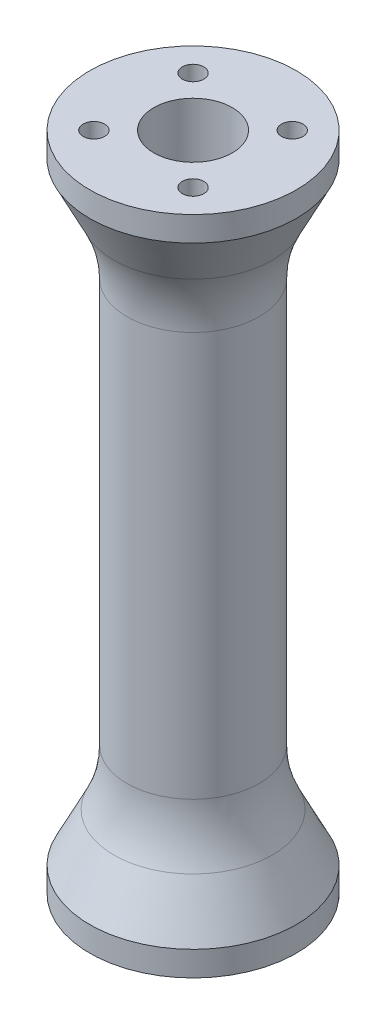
ISO-10303-21;
HEADER;
FILE_DESCRIPTION(('STEP AP214'),'2;1');
FILE_NAME('part.step','',(''),(''),'','','');
FILE_SCHEMA(('AUTOMOTIVE_DESIGN { 1 0 10303 214 1 1 1 1 }'));
ENDSEC;
DATA;
#1=APPLICATION_CONTEXT('core data for automotive mechanical design processes');
#2=APPLICATION_PROTOCOL_DEFINITION('international standard','automotive_design',2000,#1);
#3=PRODUCT_CONTEXT('',#1,'mechanical');
#4=PRODUCT('Part','Part','',(#3));
#5=PRODUCT_RELATED_PRODUCT_CATEGORY('part','',(#4));
#6=PRODUCT_DEFINITION_FORMATION('','',#4);
#7=PRODUCT_DEFINITION_CONTEXT('part definition',#1,'design');
#8=PRODUCT_DEFINITION('design','',#6,#7);
#9=PRODUCT_DEFINITION_SHAPE('','',#8);
#10=(LENGTH_UNIT() NAMED_UNIT(*) SI_UNIT(.MILLI.,.METRE.));
#11=(NAMED_UNIT(*) PLANE_ANGLE_UNIT() SI_UNIT($,.RADIAN.));
#12=(NAMED_UNIT(*) SI_UNIT($,.STERADIAN.) SOLID_ANGLE_UNIT());
#13=UNCERTAINTY_MEASURE_WITH_UNIT(LENGTH_MEASURE(1.E-05),#10,'distance_accuracy_value','');
#14=(GEOMETRIC_REPRESENTATION_CONTEXT(3) GLOBAL_UNCERTAINTY_ASSIGNED_CONTEXT((#13)) GLOBAL_UNIT_ASSIGNED_CONTEXT((#10,
#11,#12)) REPRESENTATION_CONTEXT('',''));
#15=CARTESIAN_POINT('',(0.,0.,0.));
#16=DIRECTION('',(0.,0.,1.));
#17=DIRECTION('',(1.,0.,0.));
#18=AXIS2_PLACEMENT_3D('',#15,#16,#17);
#19=CARTESIAN_POINT('',(0.,40.,0.));
#20=DIRECTION('',(0.,-1.,0.));
#21=DIRECTION('',(0.,0.,-1.));
#22=AXIS2_PLACEMENT_3D('',#19,#20,#21);
#23=PLANE('',#22);
#24=CARTESIAN_POINT('',(0.,40.,0.));
#25=DIRECTION('',(0.,1.,0.));
#26=DIRECTION('',(0.,0.,1.));
#27=AXIS2_PLACEMENT_3D('',#24,#25,#26);
#28=CIRCLE('',#27,4.75);
#29=CARTESIAN_POINT('',(0.,40.,4.75));
#30=VERTEX_POINT('',#29);
#31=EDGE_CURVE('E170',#30,#30,#28,.T.);
#32=ORIENTED_EDGE('',*,*,#31,.F.);
#33=EDGE_LOOP('',(#32));
#34=FACE_BOUND('',#33,.T.);
#35=CARTESIAN_POINT('',(6.,40.,-6.));
#36=DIRECTION('',(0.,1.,0.));
#37=DIRECTION('',(0.,0.,1.));
#38=AXIS2_PLACEMENT_3D('',#35,#36,#37);
#39=CIRCLE('',#38,1.3);
#40=CARTESIAN_POINT('',(6.,40.,-4.7));
#41=VERTEX_POINT('',#40);
#42=EDGE_CURVE('E108',#41,#41,#39,.T.);
#43=ORIENTED_EDGE('',*,*,#42,.F.);
#44=EDGE_LOOP('',(#43));
#45=FACE_BOUND('',#44,.T.);
#46=CARTESIAN_POINT('',(-6.,40.,6.));
#47=DIRECTION('',(0.,1.,0.));
#48=DIRECTION('',(0.,0.,1.));
#49=AXIS2_PLACEMENT_3D('',#46,#47,#48);
#50=CIRCLE('',#49,1.3);
#51=CARTESIAN_POINT('',(-6.,40.,7.3));
#52=VERTEX_POINT('',#51);
#53=EDGE_CURVE('E116',#52,#52,#50,.T.);
#54=ORIENTED_EDGE('',*,*,#53,.F.);
#55=EDGE_LOOP('',(#54));
#56=FACE_BOUND('',#55,.T.);
#57=CARTESIAN_POINT('',(6.,40.,6.));
#58=DIRECTION('',(0.,1.,0.));
#59=DIRECTION('',(0.,0.,1.));
#60=AXIS2_PLACEMENT_3D('',#57,#58,#59);
#61=CIRCLE('',#60,1.3);
#62=CARTESIAN_POINT('',(6.,40.,7.3));
#63=VERTEX_POINT('',#62);
#64=EDGE_CURVE('E117',#63,#63,#61,.T.);
#65=ORIENTED_EDGE('',*,*,#64,.F.);
#66=EDGE_LOOP('',(#65));
#67=FACE_BOUND('',#66,.T.);
#68=CARTESIAN_POINT('',(-6.,40.,-6.));
#69=DIRECTION('',(0.,1.,0.));
#70=DIRECTION('',(0.,0.,1.));
#71=AXIS2_PLACEMENT_3D('',#68,#69,#70);
#72=CIRCLE('',#71,1.3);
#73=CARTESIAN_POINT('',(-6.,40.,-4.7));
#74=VERTEX_POINT('',#73);
#75=EDGE_CURVE('E104',#74,#74,#72,.T.);
#76=ORIENTED_EDGE('',*,*,#75,.F.);
#77=EDGE_LOOP('',(#76));
#78=FACE_BOUND('',#77,.T.);
#79=CARTESIAN_POINT('',(0.,40.,0.));
#80=DIRECTION('',(0.,-1.,0.));
#81=DIRECTION('',(0.,0.,-1.));
#82=AXIS2_PLACEMENT_3D('',#79,#80,#81);
#83=CIRCLE('',#82,12.5);
#84=CARTESIAN_POINT('',(0.,40.,-12.5));
#85=VERTEX_POINT('',#84);
#86=EDGE_CURVE('E81',#85,#85,#83,.T.);
#87=ORIENTED_EDGE('',*,*,#86,.F.);
#88=EDGE_LOOP('',(#87));
#89=FACE_BOUND('',#88,.T.);
#90=ADVANCED_FACE('F41',(#34,#45,#56,#67,#78,#89),#23,.F.);
#91=CARTESIAN_POINT('',(0.,-40.,0.));
#92=DIRECTION('',(0.,-1.,0.));
#93=DIRECTION('',(0.,0.,-1.));
#94=AXIS2_PLACEMENT_3D('',#91,#92,#93);
#95=CYLINDRICAL_SURFACE('',#94,12.5);
#96=CARTESIAN_POINT('',(0.,37.,0.));
#97=DIRECTION('',(0.,-1.,0.));
#98=DIRECTION('',(0.,0.,-1.));
#99=AXIS2_PLACEMENT_3D('',#96,#97,#98);
#100=CIRCLE('',#99,12.5);
#101=CARTESIAN_POINT('',(0.,37.,-12.5));
#102=VERTEX_POINT('',#101);
#103=EDGE_CURVE('E91',#102,#102,#100,.T.);
#104=ORIENTED_EDGE('',*,*,#103,.F.);
#105=EDGE_LOOP('',(#104));
#106=FACE_BOUND('',#105,.T.);
#107=ORIENTED_EDGE('',*,*,#86,.T.);
#108=EDGE_LOOP('',(#107));
#109=FACE_BOUND('',#108,.T.);
#110=ADVANCED_FACE('F205',(#106,#109),#95,.T.);
#111=CARTESIAN_POINT('',(0.,37.,0.));
#112=DIRECTION('',(0.,1.,0.));
#113=DIRECTION('',(0.,0.,1.));
#114=AXIS2_PLACEMENT_3D('',#111,#112,#113);
#115=CONICAL_SURFACE('',#114,12.5,0.463647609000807);
#116=CARTESIAN_POINT('',(0.,31.1671842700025,0.));
#117=DIRECTION('',(0.,1.,0.));
#118=DIRECTION('',(0.,0.,1.));
#119=AXIS2_PLACEMENT_3D('',#116,#117,#118);
#120=CIRCLE('',#119,9.58359213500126);
#121=CARTESIAN_POINT('',(0.,31.1671842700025,9.58359213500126));
#122=VERTEX_POINT('',#121);
#123=EDGE_CURVE('E65',#122,#122,#120,.T.);
#124=ORIENTED_EDGE('',*,*,#123,.T.);
#125=EDGE_LOOP('',(#124));
#126=FACE_BOUND('',#125,.T.);
#127=ORIENTED_EDGE('',*,*,#103,.T.);
#128=EDGE_LOOP('',(#127));
#129=FACE_BOUND('',#128,.T.);
#130=ADVANCED_FACE('F211',(#126,#129),#115,.T.);
#131=CARTESIAN_POINT('',(0.,-40.,0.));
#132=DIRECTION('',(0.,-1.,0.));
#133=DIRECTION('',(0.,0.,-1.));
#134=AXIS2_PLACEMENT_3D('',#131,#132,#133);
#135=CYLINDRICAL_SURFACE('',#134,7.99999999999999);
#136=CARTESIAN_POINT('',(0.,-24.4589803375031,0.));
#137=DIRECTION('',(0.,-1.,0.));
#138=DIRECTION('',(0.,0.,-1.));
#139=AXIS2_PLACEMENT_3D('',#136,#137,#138);
#140=CIRCLE('',#139,7.99999999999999);
#141=CARTESIAN_POINT('',(0.,-24.4589803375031,-7.99999999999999));
#142=VERTEX_POINT('',#141);
#143=EDGE_CURVE('E69',#142,#142,#140,.F.);
#144=ORIENTED_EDGE('',*,*,#143,.T.);
#145=EDGE_LOOP('',(#144));
#146=FACE_BOUND('',#145,.T.);
#147=CARTESIAN_POINT('',(0.,24.4589803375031,0.));
#148=DIRECTION('',(0.,-1.,0.));
#149=DIRECTION('',(0.,0.,-1.));
#150=AXIS2_PLACEMENT_3D('',#147,#148,#149);
#151=CIRCLE('',#150,7.99999999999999);
#152=CARTESIAN_POINT('',(0.,24.4589803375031,-7.99999999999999));
#153=VERTEX_POINT('',#152);
#154=EDGE_CURVE('E73',#153,#153,#151,.T.);
#155=ORIENTED_EDGE('',*,*,#154,.T.);
#156=EDGE_LOOP('',(#155));
#157=FACE_BOUND('',#156,.T.);
#158=ADVANCED_FACE('F313',(#146,#157),#135,.T.);
#159=CARTESIAN_POINT('',(0.,-28.,0.));
#160=DIRECTION('',(0.,-1.,0.));
#161=DIRECTION('',(0.,0.,-1.));
#162=AXIS2_PLACEMENT_3D('',#159,#160,#161);
#163=CONICAL_SURFACE('',#162,7.99999999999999,0.463647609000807);
#164=CARTESIAN_POINT('',(0.,-31.1671842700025,0.));
#165=DIRECTION('',(0.,-1.,0.));
#166=DIRECTION('',(0.,0.,-1.));
#167=AXIS2_PLACEMENT_3D('',#164,#165,#166);
#168=CIRCLE('',#167,9.58359213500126);
#169=CARTESIAN_POINT('',(0.,-31.1671842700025,-9.58359213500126));
#170=VERTEX_POINT('',#169);
#171=EDGE_CURVE('E77',#170,#170,#168,.T.);
#172=ORIENTED_EDGE('',*,*,#171,.T.);
#173=EDGE_LOOP('',(#172));
#174=FACE_BOUND('',#173,.T.);
#175=CARTESIAN_POINT('',(0.,-37.,0.));
#176=DIRECTION('',(0.,-1.,0.));
#177=DIRECTION('',(0.,0.,-1.));
#178=AXIS2_PLACEMENT_3D('',#175,#176,#177);
#179=CIRCLE('',#178,12.5);
#180=CARTESIAN_POINT('',(0.,-37.,-12.5));
#181=VERTEX_POINT('',#180);
#182=EDGE_CURVE('E95',#181,#181,#179,.T.);
#183=ORIENTED_EDGE('',*,*,#182,.F.);
#184=EDGE_LOOP('',(#183));
#185=FACE_BOUND('',#184,.T.);
#186=ADVANCED_FACE('F309',(#174,#185),#163,.T.);
#187=CARTESIAN_POINT('',(0.,-40.,0.));
#188=DIRECTION('',(0.,-1.,0.));
#189=DIRECTION('',(0.,0.,-1.));
#190=AXIS2_PLACEMENT_3D('',#187,#188,#189);
#191=CYLINDRICAL_SURFACE('',#190,12.5);
#192=CARTESIAN_POINT('',(0.,-40.,0.));
#193=DIRECTION('',(0.,-1.,0.));
#194=DIRECTION('',(0.,0.,-1.));
#195=AXIS2_PLACEMENT_3D('',#192,#193,#194);
#196=CIRCLE('',#195,12.5);
#197=CARTESIAN_POINT('',(0.,-40.,-12.5));
#198=VERTEX_POINT('',#197);
#199=EDGE_CURVE('E99',#198,#198,#196,.T.);
#200=ORIENTED_EDGE('',*,*,#199,.F.);
#201=EDGE_LOOP('',(#200));
#202=FACE_BOUND('',#201,.T.);
#203=ORIENTED_EDGE('',*,*,#182,.T.);
#204=EDGE_LOOP('',(#203));
#205=FACE_BOUND('',#204,.T.);
#206=ADVANCED_FACE('F306',(#202,#205),#191,.T.);
#207=CARTESIAN_POINT('',(0.,-40.,0.));
#208=DIRECTION('',(0.,1.,0.));
#209=DIRECTION('',(0.,0.,1.));
#210=AXIS2_PLACEMENT_3D('',#207,#208,#209);
#211=PLANE('',#210);
#212=CARTESIAN_POINT('',(0.,-40.,0.));
#213=DIRECTION('',(0.,1.,0.));
#214=DIRECTION('',(0.,0.,1.));
#215=AXIS2_PLACEMENT_3D('',#212,#213,#214);
#216=CIRCLE('',#215,4.75);
#217=CARTESIAN_POINT('',(0.,-40.,4.75));
#218=VERTEX_POINT('',#217);
#219=EDGE_CURVE('E87',#218,#218,#216,.T.);
#220=ORIENTED_EDGE('',*,*,#219,.T.);
#221=EDGE_LOOP('',(#220));
#222=FACE_BOUND('',#221,.T.);
#223=CARTESIAN_POINT('',(6.,-40.,-6.));
#224=DIRECTION('',(0.,1.,0.));
#225=DIRECTION('',(0.,0.,1.));
#226=AXIS2_PLACEMENT_3D('',#223,#224,#225);
#227=CIRCLE('',#226,1.3);
#228=CARTESIAN_POINT('',(6.,-40.,-4.7));
#229=VERTEX_POINT('',#228);
#230=EDGE_CURVE('E153',#229,#229,#227,.T.);
#231=ORIENTED_EDGE('',*,*,#230,.T.);
#232=EDGE_LOOP('',(#231));
#233=FACE_BOUND('',#232,.T.);
#234=CARTESIAN_POINT('',(-6.,-40.,6.));
#235=DIRECTION('',(0.,1.,0.));
#236=DIRECTION('',(0.,0.,1.));
#237=AXIS2_PLACEMENT_3D('',#234,#235,#236);
#238=CIRCLE('',#237,1.3);
#239=CARTESIAN_POINT('',(-6.,-40.,7.3));
#240=VERTEX_POINT('',#239);
#241=EDGE_CURVE('E144',#240,#240,#238,.T.);
#242=ORIENTED_EDGE('',*,*,#241,.T.);
#243=EDGE_LOOP('',(#242));
#244=FACE_BOUND('',#243,.T.);
#245=CARTESIAN_POINT('',(6.,-40.,6.));
#246=DIRECTION('',(0.,1.,0.));
#247=DIRECTION('',(0.,0.,1.));
#248=AXIS2_PLACEMENT_3D('',#245,#246,#247);
#249=CIRCLE('',#248,1.3);
#250=CARTESIAN_POINT('',(6.,-40.,7.3));
#251=VERTEX_POINT('',#250);
#252=EDGE_CURVE('E160',#251,#251,#249,.T.);
#253=ORIENTED_EDGE('',*,*,#252,.T.);
#254=EDGE_LOOP('',(#253));
#255=FACE_BOUND('',#254,.T.);
#256=CARTESIAN_POINT('',(-6.,-40.,-6.));
#257=DIRECTION('',(0.,1.,0.));
#258=DIRECTION('',(0.,0.,1.));
#259=AXIS2_PLACEMENT_3D('',#256,#257,#258);
#260=CIRCLE('',#259,1.3);
#261=CARTESIAN_POINT('',(-6.,-40.,-4.7));
#262=VERTEX_POINT('',#261);
#263=EDGE_CURVE('E136',#262,#262,#260,.T.);
#264=ORIENTED_EDGE('',*,*,#263,.T.);
#265=EDGE_LOOP('',(#264));
#266=FACE_BOUND('',#265,.T.);
#267=ORIENTED_EDGE('',*,*,#199,.T.);
#268=EDGE_LOOP('',(#267));
#269=FACE_BOUND('',#268,.T.);
#270=ADVANCED_FACE('F178',(#222,#233,#244,#255,#266,#269),#211,.F.);
#271=CARTESIAN_POINT('',(-6.,33.,-6.));
#272=DIRECTION('',(0.,1.,0.));
#273=DIRECTION('',(0.,0.,1.));
#274=AXIS2_PLACEMENT_3D('',#271,#272,#273);
#275=CYLINDRICAL_SURFACE('',#274,1.3);
#276=CARTESIAN_POINT('',(-6.,33.,-6.));
#277=DIRECTION('',(0.,1.,0.));
#278=DIRECTION('',(0.,0.,1.));
#279=AXIS2_PLACEMENT_3D('',#276,#277,#278);
#280=CIRCLE('',#279,1.3);
#281=CARTESIAN_POINT('',(-6.,33.,-4.7));
#282=VERTEX_POINT('',#281);
#283=EDGE_CURVE('E103',#282,#282,#280,.T.);
#284=ORIENTED_EDGE('',*,*,#283,.F.);
#285=EDGE_LOOP('',(#284));
#286=FACE_BOUND('',#285,.T.);
#287=ORIENTED_EDGE('',*,*,#75,.T.);
#288=EDGE_LOOP('',(#287));
#289=FACE_BOUND('',#288,.T.);
#290=ADVANCED_FACE('F299',(#286,#289),#275,.F.);
#291=CARTESIAN_POINT('',(-6.,33.,-6.));
#292=DIRECTION('',(0.,1.,0.));
#293=DIRECTION('',(0.,0.,1.));
#294=AXIS2_PLACEMENT_3D('',#291,#292,#293);
#295=PLANE('',#294);
#296=ORIENTED_EDGE('',*,*,#283,.T.);
#297=EDGE_LOOP('',(#296));
#298=FACE_BOUND('',#297,.T.);
#299=ADVANCED_FACE('F277',(#298),#295,.T.);
#300=CARTESIAN_POINT('',(6.,33.,6.));
#301=DIRECTION('',(0.,1.,0.));
#302=DIRECTION('',(0.,0.,1.));
#303=AXIS2_PLACEMENT_3D('',#300,#301,#302);
#304=CYLINDRICAL_SURFACE('',#303,1.3);
#305=CARTESIAN_POINT('',(6.,33.,6.));
#306=DIRECTION('',(0.,1.,0.));
#307=DIRECTION('',(0.,0.,1.));
#308=AXIS2_PLACEMENT_3D('',#305,#306,#307);
#309=CIRCLE('',#308,1.3);
#310=CARTESIAN_POINT('',(6.,33.,7.3));
#311=VERTEX_POINT('',#310);
#312=EDGE_CURVE('E128',#311,#311,#309,.T.);
#313=ORIENTED_EDGE('',*,*,#312,.F.);
#314=EDGE_LOOP('',(#313));
#315=FACE_BOUND('',#314,.T.);
#316=ORIENTED_EDGE('',*,*,#64,.T.);
#317=EDGE_LOOP('',(#316));
#318=FACE_BOUND('',#317,.T.);
#319=ADVANCED_FACE('F273',(#315,#318),#304,.F.);
#320=CARTESIAN_POINT('',(6.,33.,6.));
#321=DIRECTION('',(0.,1.,0.));
#322=DIRECTION('',(0.,0.,1.));
#323=AXIS2_PLACEMENT_3D('',#320,#321,#322);
#324=PLANE('',#323);
#325=ORIENTED_EDGE('',*,*,#312,.T.);
#326=EDGE_LOOP('',(#325));
#327=FACE_BOUND('',#326,.T.);
#328=ADVANCED_FACE('F276',(#327),#324,.T.);
#329=CARTESIAN_POINT('',(-6.,33.,6.));
#330=DIRECTION('',(0.,1.,0.));
#331=DIRECTION('',(0.,0.,1.));
#332=AXIS2_PLACEMENT_3D('',#329,#330,#331);
#333=CYLINDRICAL_SURFACE('',#332,1.3);
#334=CARTESIAN_POINT('',(-6.,33.,6.));
#335=DIRECTION('',(0.,1.,0.));
#336=DIRECTION('',(0.,0.,1.));
#337=AXIS2_PLACEMENT_3D('',#334,#335,#336);
#338=CIRCLE('',#337,1.3);
#339=CARTESIAN_POINT('',(-6.,33.,7.3));
#340=VERTEX_POINT('',#339);
#341=EDGE_CURVE('E112',#340,#340,#338,.T.);
#342=ORIENTED_EDGE('',*,*,#341,.F.);
#343=EDGE_LOOP('',(#342));
#344=FACE_BOUND('',#343,.T.);
#345=ORIENTED_EDGE('',*,*,#53,.T.);
#346=EDGE_LOOP('',(#345));
#347=FACE_BOUND('',#346,.T.);
#348=ADVANCED_FACE('F281',(#344,#347),#333,.F.);
#349=CARTESIAN_POINT('',(-6.,33.,6.));
#350=DIRECTION('',(0.,1.,0.));
#351=DIRECTION('',(0.,0.,1.));
#352=AXIS2_PLACEMENT_3D('',#349,#350,#351);
#353=PLANE('',#352);
#354=ORIENTED_EDGE('',*,*,#341,.T.);
#355=EDGE_LOOP('',(#354));
#356=FACE_BOUND('',#355,.T.);
#357=ADVANCED_FACE('F286',(#356),#353,.T.);
#358=CARTESIAN_POINT('',(6.,33.,-6.));
#359=DIRECTION('',(0.,1.,0.));
#360=DIRECTION('',(0.,0.,1.));
#361=AXIS2_PLACEMENT_3D('',#358,#359,#360);
#362=CYLINDRICAL_SURFACE('',#361,1.3);
#363=CARTESIAN_POINT('',(6.,33.,-6.));
#364=DIRECTION('',(0.,1.,0.));
#365=DIRECTION('',(0.,0.,1.));
#366=AXIS2_PLACEMENT_3D('',#363,#364,#365);
#367=CIRCLE('',#366,1.3);
#368=CARTESIAN_POINT('',(6.,33.,-4.7));
#369=VERTEX_POINT('',#368);
#370=EDGE_CURVE('E121',#369,#369,#367,.T.);
#371=ORIENTED_EDGE('',*,*,#370,.F.);
#372=EDGE_LOOP('',(#371));
#373=FACE_BOUND('',#372,.T.);
#374=ORIENTED_EDGE('',*,*,#42,.T.);
#375=EDGE_LOOP('',(#374));
#376=FACE_BOUND('',#375,.T.);
#377=ADVANCED_FACE('F283',(#373,#376),#362,.F.);
#378=CARTESIAN_POINT('',(6.,33.,-6.));
#379=DIRECTION('',(0.,1.,0.));
#380=DIRECTION('',(0.,0.,1.));
#381=AXIS2_PLACEMENT_3D('',#378,#379,#380);
#382=PLANE('',#381);
#383=ORIENTED_EDGE('',*,*,#370,.T.);
#384=EDGE_LOOP('',(#383));
#385=FACE_BOUND('',#384,.T.);
#386=ADVANCED_FACE('F271',(#385),#382,.T.);
#387=CARTESIAN_POINT('',(-6.,-33.,-6.));
#388=DIRECTION('',(0.,-1.,0.));
#389=DIRECTION('',(0.,0.,-1.));
#390=AXIS2_PLACEMENT_3D('',#387,#388,#389);
#391=CYLINDRICAL_SURFACE('',#390,1.3);
#392=CARTESIAN_POINT('',(-6.,-33.,-6.));
#393=DIRECTION('',(0.,1.,0.));
#394=DIRECTION('',(0.,0.,1.));
#395=AXIS2_PLACEMENT_3D('',#392,#393,#394);
#396=CIRCLE('',#395,1.3);
#397=CARTESIAN_POINT('',(-6.,-33.,-4.7));
#398=VERTEX_POINT('',#397);
#399=EDGE_CURVE('E132',#398,#398,#396,.T.);
#400=ORIENTED_EDGE('',*,*,#399,.T.);
#401=EDGE_LOOP('',(#400));
#402=FACE_BOUND('',#401,.T.);
#403=ORIENTED_EDGE('',*,*,#263,.F.);
#404=EDGE_LOOP('',(#403));
#405=FACE_BOUND('',#404,.T.);
#406=ADVANCED_FACE('F267',(#402,#405),#391,.F.);
#407=CARTESIAN_POINT('',(-6.,-33.,-6.));
#408=DIRECTION('',(0.,-1.,0.));
#409=DIRECTION('',(0.,0.,1.));
#410=AXIS2_PLACEMENT_3D('',#407,#408,#409);
#411=PLANE('',#410);
#412=ORIENTED_EDGE('',*,*,#399,.F.);
#413=EDGE_LOOP('',(#412));
#414=FACE_BOUND('',#413,.T.);
#415=ADVANCED_FACE('F249',(#414),#411,.T.);
#416=CARTESIAN_POINT('',(6.,-33.,6.));
#417=DIRECTION('',(0.,-1.,0.));
#418=DIRECTION('',(0.,0.,-1.));
#419=AXIS2_PLACEMENT_3D('',#416,#417,#418);
#420=CYLINDRICAL_SURFACE('',#419,1.3);
#421=CARTESIAN_POINT('',(6.,-33.,6.));
#422=DIRECTION('',(0.,1.,0.));
#423=DIRECTION('',(0.,0.,1.));
#424=AXIS2_PLACEMENT_3D('',#421,#422,#423);
#425=CIRCLE('',#424,1.3);
#426=CARTESIAN_POINT('',(6.,-33.,7.3));
#427=VERTEX_POINT('',#426);
#428=EDGE_CURVE('E149',#427,#427,#425,.T.);
#429=ORIENTED_EDGE('',*,*,#428,.T.);
#430=EDGE_LOOP('',(#429));
#431=FACE_BOUND('',#430,.T.);
#432=ORIENTED_EDGE('',*,*,#252,.F.);
#433=EDGE_LOOP('',(#432));
#434=FACE_BOUND('',#433,.T.);
#435=ADVANCED_FACE('F245',(#431,#434),#420,.F.);
#436=CARTESIAN_POINT('',(6.,-33.,6.));
#437=DIRECTION('',(0.,-1.,0.));
#438=DIRECTION('',(0.,0.,1.));
#439=AXIS2_PLACEMENT_3D('',#436,#437,#438);
#440=PLANE('',#439);
#441=ORIENTED_EDGE('',*,*,#428,.F.);
#442=EDGE_LOOP('',(#441));
#443=FACE_BOUND('',#442,.T.);
#444=ADVANCED_FACE('F241',(#443),#440,.T.);
#445=CARTESIAN_POINT('',(-6.,-33.,6.));
#446=DIRECTION('',(0.,-1.,0.));
#447=DIRECTION('',(0.,0.,-1.));
#448=AXIS2_PLACEMENT_3D('',#445,#446,#447);
#449=CYLINDRICAL_SURFACE('',#448,1.3);
#450=CARTESIAN_POINT('',(-6.,-33.,6.));
#451=DIRECTION('',(0.,1.,0.));
#452=DIRECTION('',(0.,0.,1.));
#453=AXIS2_PLACEMENT_3D('',#450,#451,#452);
#454=CIRCLE('',#453,1.3);
#455=CARTESIAN_POINT('',(-6.,-33.,7.3));
#456=VERTEX_POINT('',#455);
#457=EDGE_CURVE('E148',#456,#456,#454,.T.);
#458=ORIENTED_EDGE('',*,*,#457,.T.);
#459=EDGE_LOOP('',(#458));
#460=FACE_BOUND('',#459,.T.);
#461=ORIENTED_EDGE('',*,*,#241,.F.);
#462=EDGE_LOOP('',(#461));
#463=FACE_BOUND('',#462,.T.);
#464=ADVANCED_FACE('F244',(#460,#463),#449,.F.);
#465=CARTESIAN_POINT('',(-6.,-33.,6.));
#466=DIRECTION('',(0.,-1.,0.));
#467=DIRECTION('',(0.,0.,1.));
#468=AXIS2_PLACEMENT_3D('',#465,#466,#467);
#469=PLANE('',#468);
#470=ORIENTED_EDGE('',*,*,#457,.F.);
#471=EDGE_LOOP('',(#470));
#472=FACE_BOUND('',#471,.T.);
#473=ADVANCED_FACE('F257',(#472),#469,.T.);
#474=CARTESIAN_POINT('',(6.,-33.,-6.));
#475=DIRECTION('',(0.,-1.,0.));
#476=DIRECTION('',(0.,0.,-1.));
#477=AXIS2_PLACEMENT_3D('',#474,#475,#476);
#478=CYLINDRICAL_SURFACE('',#477,1.3);
#479=CARTESIAN_POINT('',(6.,-33.,-6.));
#480=DIRECTION('',(0.,1.,0.));
#481=DIRECTION('',(0.,0.,1.));
#482=AXIS2_PLACEMENT_3D('',#479,#480,#481);
#483=CIRCLE('',#482,1.3);
#484=CARTESIAN_POINT('',(6.,-33.,-4.7));
#485=VERTEX_POINT('',#484);
#486=EDGE_CURVE('E140',#485,#485,#483,.T.);
#487=ORIENTED_EDGE('',*,*,#486,.T.);
#488=EDGE_LOOP('',(#487));
#489=FACE_BOUND('',#488,.T.);
#490=ORIENTED_EDGE('',*,*,#230,.F.);
#491=EDGE_LOOP('',(#490));
#492=FACE_BOUND('',#491,.T.);
#493=ADVANCED_FACE('F253',(#489,#492),#478,.F.);
#494=CARTESIAN_POINT('',(6.,-33.,-6.));
#495=DIRECTION('',(0.,-1.,0.));
#496=DIRECTION('',(0.,0.,1.));
#497=AXIS2_PLACEMENT_3D('',#494,#495,#496);
#498=PLANE('',#497);
#499=ORIENTED_EDGE('',*,*,#486,.F.);
#500=EDGE_LOOP('',(#499));
#501=FACE_BOUND('',#500,.T.);
#502=ADVANCED_FACE('F185',(#501),#498,.T.);
#503=CARTESIAN_POINT('',(0.,-40.,0.));
#504=DIRECTION('',(0.,1.,0.));
#505=DIRECTION('',(0.,0.,1.));
#506=AXIS2_PLACEMENT_3D('',#503,#504,#505);
#507=CYLINDRICAL_SURFACE('',#506,4.75);
#508=ORIENTED_EDGE('',*,*,#219,.F.);
#509=EDGE_LOOP('',(#508));
#510=FACE_BOUND('',#509,.T.);
#511=CARTESIAN_POINT('',(0.,-31.95,0.));
#512=DIRECTION('',(0.,1.,0.));
#513=DIRECTION('',(0.,0.,1.));
#514=AXIS2_PLACEMENT_3D('',#511,#512,#513);
#515=CIRCLE('',#514,4.75);
#516=CARTESIAN_POINT('',(0.,-31.95,4.74999999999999));
#517=VERTEX_POINT('',#516);
#518=EDGE_CURVE('E82',#517,#517,#515,.F.);
#519=ORIENTED_EDGE('',*,*,#518,.F.);
#520=EDGE_LOOP('',(#519));
#521=FACE_BOUND('',#520,.T.);
#522=ADVANCED_FACE('F181',(#510,#521),#507,.F.);
#523=ORIENTED_EDGE('',*,*,#31,.T.);
#524=EDGE_LOOP('',(#523));
#525=FACE_BOUND('',#524,.T.);
#526=CARTESIAN_POINT('',(0.,31.95,0.));
#527=DIRECTION('',(0.,-1.,0.));
#528=DIRECTION('',(0.,0.,-1.));
#529=AXIS2_PLACEMENT_3D('',#526,#527,#528);
#530=CIRCLE('',#529,4.75);
#531=CARTESIAN_POINT('',(0.,31.95,-4.75));
#532=VERTEX_POINT('',#531);
#533=EDGE_CURVE('E86',#532,#532,#530,.F.);
#534=ORIENTED_EDGE('',*,*,#533,.F.);
#535=EDGE_LOOP('',(#534));
#536=FACE_BOUND('',#535,.T.);
#537=ADVANCED_FACE('F184',(#525,#536),#507,.F.);
#538=CARTESIAN_POINT('',(0.,36.6999999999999,0.));
#539=DIRECTION('',(0.,1.,0.));
#540=DIRECTION('',(0.,0.,1.));
#541=AXIS2_PLACEMENT_3D('',#538,#539,#540);
#542=CYLINDRICAL_SURFACE('',#541,7.);
#543=CARTESIAN_POINT('',(0.,-28.0431457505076,0.));
#544=DIRECTION('',(0.,1.,0.));
#545=DIRECTION('',(0.,0.,1.));
#546=AXIS2_PLACEMENT_3D('',#543,#544,#545);
#547=CIRCLE('',#546,7.);
#548=CARTESIAN_POINT('',(0.,-28.0431457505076,6.99999999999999));
#549=VERTEX_POINT('',#548);
#550=EDGE_CURVE('E49',#549,#549,#547,.F.);
#551=ORIENTED_EDGE('',*,*,#550,.T.);
#552=EDGE_LOOP('',(#551));
#553=FACE_BOUND('',#552,.T.);
#554=CARTESIAN_POINT('',(0.,28.0431457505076,0.));
#555=DIRECTION('',(0.,1.,0.));
#556=DIRECTION('',(0.,0.,1.));
#557=AXIS2_PLACEMENT_3D('',#554,#555,#556);
#558=CIRCLE('',#557,7.);
#559=CARTESIAN_POINT('',(0.,28.0431457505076,7.));
#560=VERTEX_POINT('',#559);
#561=EDGE_CURVE('E54',#560,#560,#558,.T.);
#562=ORIENTED_EDGE('',*,*,#561,.T.);
#563=EDGE_LOOP('',(#562));
#564=FACE_BOUND('',#563,.T.);
#565=ADVANCED_FACE('F202',(#553,#564),#542,.F.);
#566=CARTESIAN_POINT('',(0.,36.6999999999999,0.));
#567=DIRECTION('',(0.,-1.,0.));
#568=DIRECTION('',(0.,0.,-1.));
#569=AXIS2_PLACEMENT_3D('',#566,#567,#568);
#570=CONICAL_SURFACE('',#569,0.,0.785398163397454);
#571=CARTESIAN_POINT('',(0.,30.8715728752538,0.));
#572=DIRECTION('',(0.,-1.,0.));
#573=DIRECTION('',(0.,0.,-1.));
#574=AXIS2_PLACEMENT_3D('',#571,#572,#573);
#575=CIRCLE('',#574,5.82842712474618);
#576=CARTESIAN_POINT('',(0.,30.8715728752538,-5.82842712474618));
#577=VERTEX_POINT('',#576);
#578=EDGE_CURVE('E10',#577,#577,#575,.T.);
#579=ORIENTED_EDGE('',*,*,#578,.T.);
#580=EDGE_LOOP('',(#579));
#581=FACE_BOUND('',#580,.T.);
#582=ORIENTED_EDGE('',*,*,#533,.T.);
#583=EDGE_LOOP('',(#582));
#584=FACE_BOUND('',#583,.T.);
#585=ADVANCED_FACE('F192',(#581,#584),#570,.F.);
#586=CARTESIAN_POINT('',(0.,-29.7,0.));
#587=DIRECTION('',(0.,1.,0.));
#588=DIRECTION('',(0.,0.,1.));
#589=AXIS2_PLACEMENT_3D('',#586,#587,#588);
#590=CONICAL_SURFACE('',#589,7.,0.785398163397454);
#591=CARTESIAN_POINT('',(0.,-30.8715728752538,0.));
#592=DIRECTION('',(0.,1.,0.));
#593=DIRECTION('',(0.,0.,1.));
#594=AXIS2_PLACEMENT_3D('',#591,#592,#593);
#595=CIRCLE('',#594,5.82842712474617);
#596=CARTESIAN_POINT('',(0.,-30.8715728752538,5.82842712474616));
#597=VERTEX_POINT('',#596);
#598=EDGE_CURVE('E59',#597,#597,#595,.T.);
#599=ORIENTED_EDGE('',*,*,#598,.T.);
#600=EDGE_LOOP('',(#599));
#601=FACE_BOUND('',#600,.T.);
#602=ORIENTED_EDGE('',*,*,#518,.T.);
#603=EDGE_LOOP('',(#602));
#604=FACE_BOUND('',#603,.T.);
#605=ADVANCED_FACE('F189',(#601,#604),#590,.F.);
#606=CARTESIAN_POINT('',(0.,-24.4589803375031,0.));
#607=DIRECTION('',(0.,-1.,0.));
#608=DIRECTION('',(0.,0.,-1.));
#609=AXIS2_PLACEMENT_3D('',#606,#607,#608);
#610=TOROIDAL_SURFACE('',#609,23.,15.);
#611=ORIENTED_EDGE('',*,*,#143,.F.);
#612=EDGE_LOOP('',(#611));
#613=FACE_BOUND('',#612,.T.);
#614=ORIENTED_EDGE('',*,*,#171,.F.);
#615=EDGE_LOOP('',(#614));
#616=FACE_BOUND('',#615,.T.);
#617=ADVANCED_FACE('F191',(#613,#616),#610,.F.);
#618=CARTESIAN_POINT('',(0.,24.4589803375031,0.));
#619=DIRECTION('',(0.,-1.,0.));
#620=DIRECTION('',(0.,0.,-1.));
#621=AXIS2_PLACEMENT_3D('',#618,#619,#620);
#622=TOROIDAL_SURFACE('',#621,23.,15.);
#623=ORIENTED_EDGE('',*,*,#123,.F.);
#624=EDGE_LOOP('',(#623));
#625=FACE_BOUND('',#624,.T.);
#626=ORIENTED_EDGE('',*,*,#154,.F.);
#627=EDGE_LOOP('',(#626));
#628=FACE_BOUND('',#627,.T.);
#629=ADVANCED_FACE('F199',(#625,#628),#622,.F.);
#630=CARTESIAN_POINT('',(0.,-28.0431457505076,0.));
#631=DIRECTION('',(0.,1.,0.));
#632=DIRECTION('',(0.,0.,1.));
#633=AXIS2_PLACEMENT_3D('',#630,#631,#632);
#634=DEGENERATE_TOROIDAL_SURFACE('',#633,3.,4.,.T.);
#635=ORIENTED_EDGE('',*,*,#550,.F.);
#636=EDGE_LOOP('',(#635));
#637=FACE_BOUND('',#636,.T.);
#638=ORIENTED_EDGE('',*,*,#598,.F.);
#639=EDGE_LOOP('',(#638));
#640=FACE_BOUND('',#639,.T.);
#641=ADVANCED_FACE('F219',(#637,#640),#634,.F.);
#642=CARTESIAN_POINT('',(0.,28.0431457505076,0.));
#643=DIRECTION('',(0.,1.,0.));
#644=DIRECTION('',(0.,0.,1.));
#645=AXIS2_PLACEMENT_3D('',#642,#643,#644);
#646=DEGENERATE_TOROIDAL_SURFACE('',#645,3.,4.,.T.);
#647=ORIENTED_EDGE('',*,*,#578,.F.);
#648=EDGE_LOOP('',(#647));
#649=FACE_BOUND('',#648,.T.);
#650=ORIENTED_EDGE('',*,*,#561,.F.);
#651=EDGE_LOOP('',(#650));
#652=FACE_BOUND('',#651,.T.);
#653=ADVANCED_FACE('F43',(#649,#652),#646,.F.);
#654=CLOSED_SHELL('',(#90,#110,#130,#158,#186,#206,#270,#290,#299,#319,#328,#348,#357,#377,#386,
#406,#415,#435,#444,#464,#473,#493,#502,#522,#537,#565,#585,#605,#617,#629,#641,#653));
#655=MANIFOLD_SOLID_BREP('B2',#654);
#656=ADVANCED_BREP_SHAPE_REPRESENTATION('',(#18,#655),#14);
#657=SHAPE_DEFINITION_REPRESENTATION(#9,#656);
ENDSEC;
END-ISO-10303-21;
